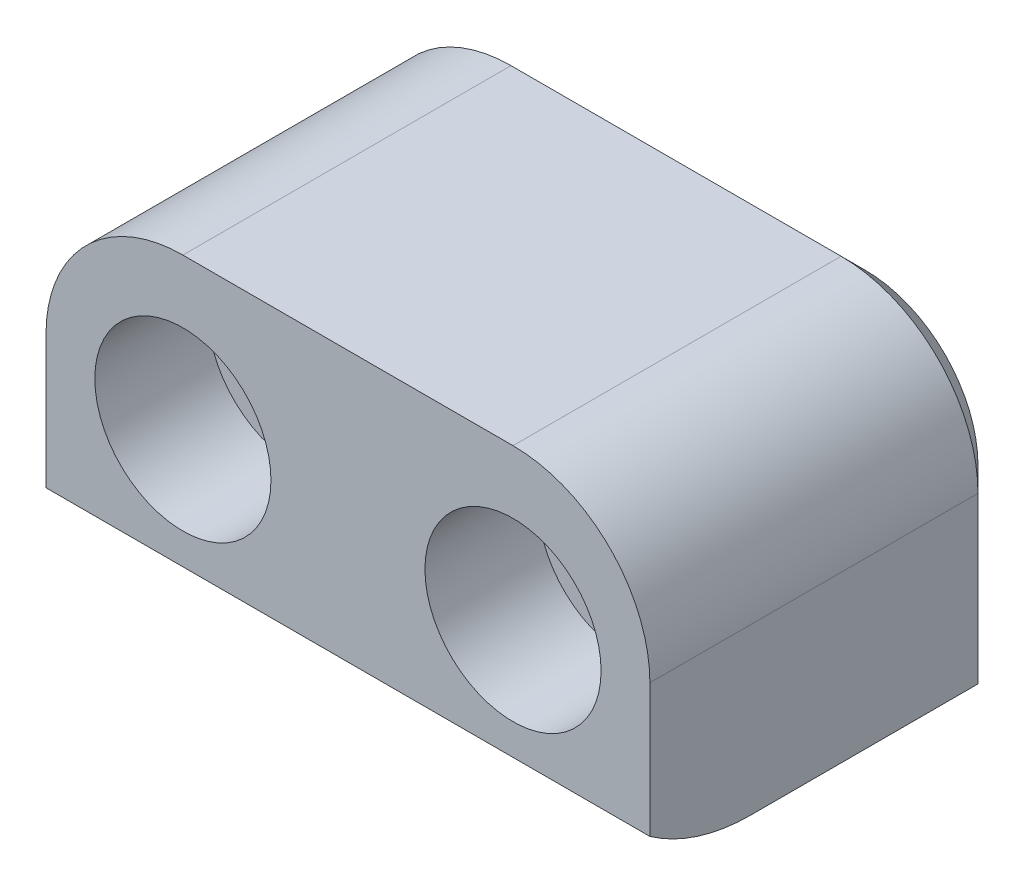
from build123d import *

# Parameters (mm, degrees)
SKETCH3_W                  = 38.1
SKETCH3_H                  = 19.05
EXTRUDE1_DEPTH             = 22.225
FILLET1_R                  = 8.636
F_1_4_20_CBORE_D           = 6.5278
F_1_4_20_CBORE_CBORE_D     = 11.1125
F_1_4_20_CBORE_CBORE_DEPTH = 7.14502
CUT_EXTRUDE1_DEPTH         = 49.046468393
CHAMFER1_SIZE              = 1.524


with BuildPart() as part:
    # Sketch3 → Extrude1 (new body)
    with BuildSketch(Plane.XY):
        with Locations((19.05, 9.525)):
            Rectangle(SKETCH3_W, SKETCH3_H)
    extrude(amount=-EXTRUDE1_DEPTH)

    # Fillet1
    fillet1_edges = [part.edges().sort_by_distance(p)[0] for p in [
        (0, 19.05, -11.1125),
        (38.1, 19.05, -11.1125),
    ]]
    fillet(fillet1_edges, radius=FILLET1_R)

    # 1_4_-20 CBORE (through all)
    with Locations(Plane.XY):
        with Locations((8.636, 9.525), (29.464, 9.525)):
            CounterBoreHole(F_1_4_20_CBORE_D / 2, F_1_4_20_CBORE_CBORE_D / 2, F_1_4_20_CBORE_CBORE_DEPTH)

    # Sketch8 → Cut-Extrude1 (cut, through all)
    with BuildSketch(Plane.ZY):
        with BuildLine():
            Line((0, 2.016820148), (12.7, 2.016820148))
            Line((12.7, 2.016820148), (12.7, -10.683179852))
            Line((12.7, -10.683179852), (-6.35, -10.683179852))
            Line((-6.35, -10.683179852), (-6.35, 0))
            ThreePointArc((-6.35, 0), (-3.018706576, 0.516316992), (0, 2.016820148))
        make_face()
    extrude(amount=-CUT_EXTRUDE1_DEPTH, mode=Mode.SUBTRACT)

    # Chamfer1
    chamfer1_edges = [part.edges().sort_by_distance(p)[0] for p in [
        (38.1, 5.207, -22.225),
        (19.05, 19.05, -22.225),
        (0, 5.207, -22.225),
        (35.570574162, 16.520574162, -22.225),
        (2.529425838, 16.520574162, -22.225),
    ]]
    chamfer(chamfer1_edges, length=CHAMFER1_SIZE)


solid = part.part
